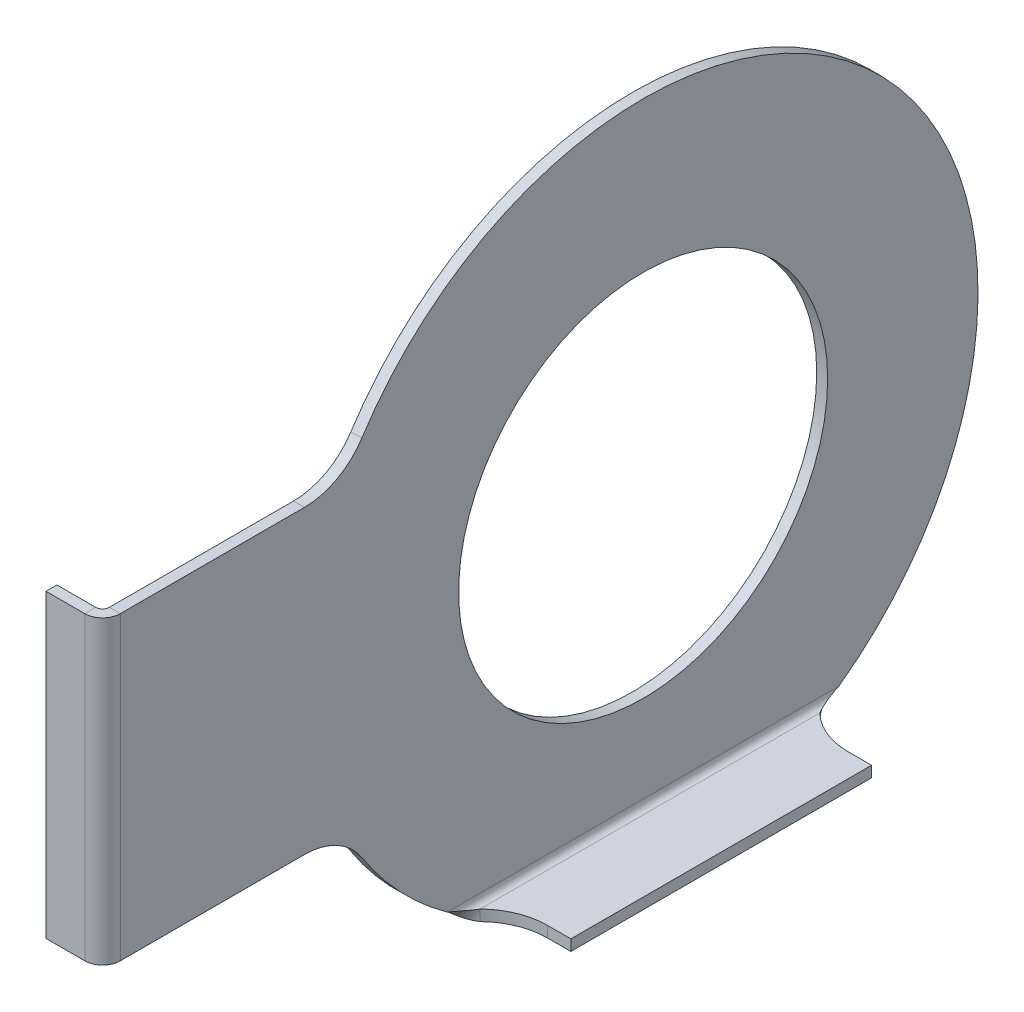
ISO-10303-21;
HEADER;
FILE_DESCRIPTION(('STEP AP214'),'2;1');
FILE_NAME('part.step','',(''),(''),'','','');
FILE_SCHEMA(('AUTOMOTIVE_DESIGN { 1 0 10303 214 1 1 1 1 }'));
ENDSEC;
DATA;
#1=APPLICATION_CONTEXT('core data for automotive mechanical design processes');
#2=APPLICATION_PROTOCOL_DEFINITION('international standard','automotive_design',2000,#1);
#3=PRODUCT_CONTEXT('',#1,'mechanical');
#4=PRODUCT('Part','Part','',(#3));
#5=PRODUCT_RELATED_PRODUCT_CATEGORY('part','',(#4));
#6=PRODUCT_DEFINITION_FORMATION('','',#4);
#7=PRODUCT_DEFINITION_CONTEXT('part definition',#1,'design');
#8=PRODUCT_DEFINITION('design','',#6,#7);
#9=PRODUCT_DEFINITION_SHAPE('','',#8);
#10=(LENGTH_UNIT() NAMED_UNIT(*) SI_UNIT(.MILLI.,.METRE.));
#11=(NAMED_UNIT(*) PLANE_ANGLE_UNIT() SI_UNIT($,.RADIAN.));
#12=(NAMED_UNIT(*) SI_UNIT($,.STERADIAN.) SOLID_ANGLE_UNIT());
#13=UNCERTAINTY_MEASURE_WITH_UNIT(LENGTH_MEASURE(1.E-05),#10,'distance_accuracy_value','');
#14=(GEOMETRIC_REPRESENTATION_CONTEXT(3) GLOBAL_UNCERTAINTY_ASSIGNED_CONTEXT((#13)) GLOBAL_UNIT_ASSIGNED_CONTEXT((#10,
#11,#12)) REPRESENTATION_CONTEXT('',''));
#15=CARTESIAN_POINT('',(0.,0.,0.));
#16=DIRECTION('',(0.,0.,1.));
#17=DIRECTION('',(1.,0.,0.));
#18=AXIS2_PLACEMENT_3D('',#15,#16,#17);
#19=CARTESIAN_POINT('',(0.,32.,49.5681349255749));
#20=DIRECTION('',(-1.,0.,0.));
#21=DIRECTION('',(0.,0.,1.));
#22=AXIS2_PLACEMENT_3D('',#19,#20,#21);
#23=PLANE('',#22);
#24=CARTESIAN_POINT('',(0.,0.,0.));
#25=DIRECTION('',(1.,0.,0.));
#26=DIRECTION('',(0.,0.,-1.));
#27=AXIS2_PLACEMENT_3D('',#24,#25,#26);
#28=CIRCLE('',#27,27.);
#29=CARTESIAN_POINT('',(0.,0.,-27.));
#30=VERTEX_POINT('',#29);
#31=EDGE_CURVE('E666',#30,#30,#28,.T.);
#32=ORIENTED_EDGE('',*,*,#31,.T.);
#33=EDGE_LOOP('',(#32));
#34=FACE_BOUND('',#33,.T.);
#35=DIRECTION('',(0.,0.,-1.));
#36=VECTOR('',#35,1.);
#37=CARTESIAN_POINT('',(0.,-22.,49.5681349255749));
#38=LINE('',#37,#36);
#39=CARTESIAN_POINT('',(0.,-22.,76.5));
#40=VERTEX_POINT('',#39);
#41=CARTESIAN_POINT('',(0.,-22.,49.5681349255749));
#42=VERTEX_POINT('',#41);
#43=EDGE_CURVE('E95',#40,#42,#38,.T.);
#44=ORIENTED_EDGE('',*,*,#43,.F.);
#45=DIRECTION('',(0.,1.,0.));
#46=VECTOR('',#45,1.);
#47=CARTESIAN_POINT('',(0.,32.,76.5));
#48=LINE('',#47,#46);
#49=CARTESIAN_POINT('',(0.,22.,76.5));
#50=VERTEX_POINT('',#49);
#51=EDGE_CURVE('E83',#40,#50,#48,.T.);
#52=ORIENTED_EDGE('',*,*,#51,.T.);
#53=DIRECTION('',(0.,0.,1.));
#54=VECTOR('',#53,1.);
#55=CARTESIAN_POINT('',(0.,22.,49.5681349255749));
#56=LINE('',#55,#54);
#57=CARTESIAN_POINT('',(0.,22.,49.5681349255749));
#58=VERTEX_POINT('',#57);
#59=EDGE_CURVE('E99',#58,#50,#56,.T.);
#60=ORIENTED_EDGE('',*,*,#59,.F.);
#61=CARTESIAN_POINT('',(0.,32.,49.5681349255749));
#62=DIRECTION('',(-1.,0.,0.));
#63=DIRECTION('',(0.,0.,1.));
#64=AXIS2_PLACEMENT_3D('',#61,#62,#63);
#65=CIRCLE('',#64,10.);
#66=CARTESIAN_POINT('',(0.,26.5762711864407,41.16675612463));
#67=VERTEX_POINT('',#66);
#68=EDGE_CURVE('E645',#67,#58,#65,.T.);
#69=ORIENTED_EDGE('',*,*,#68,.F.);
#70=CARTESIAN_POINT('',(0.,0.,0.));
#71=DIRECTION('',(1.,0.,0.));
#72=DIRECTION('',(0.,0.,-1.));
#73=AXIS2_PLACEMENT_3D('',#70,#71,#72);
#74=CIRCLE('',#73,49.);
#75=CARTESIAN_POINT('',(0.,-39.75,-28.6520069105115));
#76=VERTEX_POINT('',#75);
#77=EDGE_CURVE('E535',#76,#67,#74,.T.);
#78=ORIENTED_EDGE('',*,*,#77,.F.);
#79=DIRECTION('',(0.,0.,1.));
#80=VECTOR('',#79,1.);
#81=CARTESIAN_POINT('',(0.,-39.75,49.5681349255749));
#82=LINE('',#81,#80);
#83=CARTESIAN_POINT('',(0.,-39.75,28.6520069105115));
#84=VERTEX_POINT('',#83);
#85=EDGE_CURVE('E498',#76,#84,#82,.T.);
#86=ORIENTED_EDGE('',*,*,#85,.T.);
#87=CARTESIAN_POINT('',(0.,0.,0.));
#88=DIRECTION('',(1.,0.,0.));
#89=DIRECTION('',(0.,0.,-1.));
#90=AXIS2_PLACEMENT_3D('',#87,#88,#89);
#91=CIRCLE('',#90,49.);
#92=CARTESIAN_POINT('',(0.,-26.5762711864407,41.16675612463));
#93=VERTEX_POINT('',#92);
#94=EDGE_CURVE('E660',#93,#84,#91,.T.);
#95=ORIENTED_EDGE('',*,*,#94,.F.);
#96=CARTESIAN_POINT('',(0.,-32.,49.5681349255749));
#97=DIRECTION('',(-1.,0.,0.));
#98=DIRECTION('',(0.,0.,-1.));
#99=AXIS2_PLACEMENT_3D('',#96,#97,#98);
#100=CIRCLE('',#99,10.);
#101=EDGE_CURVE('E483',#42,#93,#100,.T.);
#102=ORIENTED_EDGE('',*,*,#101,.F.);
#103=EDGE_LOOP('',(#44,#52,#60,#69,#78,#86,#95,#102));
#104=FACE_BOUND('',#103,.T.);
#105=ADVANCED_FACE('F74',(#34,#104),#23,.T.);
#106=CARTESIAN_POINT('',(9.59070153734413,-40.75,-32.));
#107=DIRECTION('',(0.,-1.,0.));
#108=DIRECTION('',(0.,0.,1.));
#109=AXIS2_PLACEMENT_3D('',#106,#107,#108);
#110=CYLINDRICAL_SURFACE('',#109,10.);
#111=CARTESIAN_POINT('',(9.59070153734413,-42.35,-32.));
#112=DIRECTION('',(0.,-1.,0.));
#113=DIRECTION('',(0.,0.,-1.));
#114=AXIS2_PLACEMENT_3D('',#111,#112,#113);
#115=CIRCLE('',#114,10.);
#116=CARTESIAN_POINT('',(9.59070153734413,-42.35,-22.));
#117=VERTEX_POINT('',#116);
#118=CARTESIAN_POINT('',(2.60000000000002,-42.35,-24.8494691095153));
#119=VERTEX_POINT('',#118);
#120=EDGE_CURVE('E553',#117,#119,#115,.T.);
#121=ORIENTED_EDGE('',*,*,#120,.T.);
#122=CARTESIAN_POINT('',(2.60000000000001,-40.75,-24.8494691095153));
#123=CARTESIAN_POINT('',(2.60000000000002,-42.35,-24.8494691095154));
#124=B_SPLINE_CURVE_WITH_KNOTS('',1,(#122,#123),.UNSPECIFIED.,.F.,.F.,(2,2),(0.,1.),.UNSPECIFIED.);
#125=CARTESIAN_POINT('',(2.60000000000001,-40.75,-24.8494691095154));
#126=VERTEX_POINT('',#125);
#127=EDGE_CURVE('E350',#119,#126,#124,.F.);
#128=ORIENTED_EDGE('',*,*,#127,.T.);
#129=CARTESIAN_POINT('',(9.59070153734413,-40.75,-32.));
#130=DIRECTION('',(0.,-1.,0.));
#131=DIRECTION('',(0.,0.,-1.));
#132=AXIS2_PLACEMENT_3D('',#129,#130,#131);
#133=CIRCLE('',#132,10.);
#134=CARTESIAN_POINT('',(9.59070153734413,-40.75,-22.));
#135=VERTEX_POINT('',#134);
#136=EDGE_CURVE('E542',#135,#126,#133,.T.);
#137=ORIENTED_EDGE('',*,*,#136,.F.);
#138=DIRECTION('',(0.,-1.,0.));
#139=VECTOR('',#138,1.);
#140=CARTESIAN_POINT('',(9.59070153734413,-40.75,-22.));
#141=LINE('',#140,#139);
#142=EDGE_CURVE('E552',#135,#117,#141,.T.);
#143=ORIENTED_EDGE('',*,*,#142,.T.);
#144=EDGE_LOOP('',(#121,#128,#137,#143));
#145=FACE_BOUND('',#144,.T.);
#146=ADVANCED_FACE('F584',(#145),#110,.F.);
#147=CARTESIAN_POINT('',(9.59070153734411,-40.75,32.));
#148=DIRECTION('',(0.,-1.,0.));
#149=DIRECTION('',(0.,0.,1.));
#150=AXIS2_PLACEMENT_3D('',#147,#148,#149);
#151=CYLINDRICAL_SURFACE('',#150,10.);
#152=CARTESIAN_POINT('',(9.59070153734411,-40.75,32.));
#153=DIRECTION('',(0.,-1.,0.));
#154=DIRECTION('',(0.,0.,-1.));
#155=AXIS2_PLACEMENT_3D('',#152,#153,#154);
#156=CIRCLE('',#155,10.);
#157=CARTESIAN_POINT('',(2.6,-40.75,24.8494691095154));
#158=VERTEX_POINT('',#157);
#159=CARTESIAN_POINT('',(9.59070153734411,-40.75,22.));
#160=VERTEX_POINT('',#159);
#161=EDGE_CURVE('E538',#158,#160,#156,.T.);
#162=ORIENTED_EDGE('',*,*,#161,.F.);
#163=CARTESIAN_POINT('',(2.60000000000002,-42.35,24.8494691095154));
#164=CARTESIAN_POINT('',(2.60000000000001,-40.75,24.8494691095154));
#165=B_SPLINE_CURVE_WITH_KNOTS('',1,(#163,#164),.UNSPECIFIED.,.F.,.F.,(2,2),(0.,1.),.UNSPECIFIED.);
#166=CARTESIAN_POINT('',(2.60000000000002,-42.35,24.8494691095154));
#167=VERTEX_POINT('',#166);
#168=EDGE_CURVE('E419',#158,#167,#165,.F.);
#169=ORIENTED_EDGE('',*,*,#168,.T.);
#170=CARTESIAN_POINT('',(9.59070153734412,-42.35,32.));
#171=DIRECTION('',(0.,-1.,0.));
#172=DIRECTION('',(0.,0.,-1.));
#173=AXIS2_PLACEMENT_3D('',#170,#171,#172);
#174=CIRCLE('',#173,10.);
#175=CARTESIAN_POINT('',(9.59070153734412,-42.35,22.));
#176=VERTEX_POINT('',#175);
#177=EDGE_CURVE('E550',#167,#176,#174,.T.);
#178=ORIENTED_EDGE('',*,*,#177,.T.);
#179=DIRECTION('',(0.,-1.,0.));
#180=VECTOR('',#179,1.);
#181=CARTESIAN_POINT('',(9.59070153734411,-40.75,22.));
#182=LINE('',#181,#180);
#183=EDGE_CURVE('E561',#160,#176,#182,.T.);
#184=ORIENTED_EDGE('',*,*,#183,.F.);
#185=EDGE_LOOP('',(#162,#169,#178,#184));
#186=FACE_BOUND('',#185,.T.);
#187=ADVANCED_FACE('F592',(#186),#151,.F.);
#188=CARTESIAN_POINT('',(-71.9774333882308,-40.7500000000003,49.5681349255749));
#189=DIRECTION('',(0.,-1.,0.));
#190=DIRECTION('',(0.,0.,1.));
#191=AXIS2_PLACEMENT_3D('',#188,#189,#190);
#192=PLANE('',#191);
#193=ORIENTED_EDGE('',*,*,#136,.T.);
#194=DIRECTION('',(0.,0.,1.));
#195=VECTOR('',#194,1.);
#196=CARTESIAN_POINT('',(2.59999999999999,-40.75,49.5681349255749));
#197=LINE('',#196,#195);
#198=EDGE_CURVE('E562',#126,#158,#197,.T.);
#199=ORIENTED_EDGE('',*,*,#198,.T.);
#200=ORIENTED_EDGE('',*,*,#161,.T.);
#201=DIRECTION('',(1.,0.,0.));
#202=VECTOR('',#201,1.);
#203=CARTESIAN_POINT('',(9.59070153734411,-40.75,22.));
#204=LINE('',#203,#202);
#205=CARTESIAN_POINT('',(13.0225666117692,-40.75,22.));
#206=VERTEX_POINT('',#205);
#207=EDGE_CURVE('E536',#160,#206,#204,.T.);
#208=ORIENTED_EDGE('',*,*,#207,.T.);
#209=DIRECTION('',(0.,0.,-1.));
#210=VECTOR('',#209,1.);
#211=CARTESIAN_POINT('',(13.0225666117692,-40.75,22.));
#212=LINE('',#211,#210);
#213=CARTESIAN_POINT('',(13.0225666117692,-40.75,-22.));
#214=VERTEX_POINT('',#213);
#215=EDGE_CURVE('E539',#206,#214,#212,.T.);
#216=ORIENTED_EDGE('',*,*,#215,.T.);
#217=DIRECTION('',(-1.,0.,0.));
#218=VECTOR('',#217,1.);
#219=CARTESIAN_POINT('',(9.59070153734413,-40.75,-22.));
#220=LINE('',#219,#218);
#221=EDGE_CURVE('E541',#214,#135,#220,.T.);
#222=ORIENTED_EDGE('',*,*,#221,.T.);
#223=EDGE_LOOP('',(#193,#199,#200,#208,#216,#222));
#224=FACE_BOUND('',#223,.T.);
#225=ADVANCED_FACE('F593',(#224),#192,.F.);
#226=CARTESIAN_POINT('',(-71.9774333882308,-42.3500000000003,49.5681349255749));
#227=DIRECTION('',(0.,-1.,0.));
#228=DIRECTION('',(0.,0.,1.));
#229=AXIS2_PLACEMENT_3D('',#226,#227,#228);
#230=PLANE('',#229);
#231=DIRECTION('',(0.,0.,1.));
#232=VECTOR('',#231,1.);
#233=CARTESIAN_POINT('',(2.6,-42.35,49.5681349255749));
#234=LINE('',#233,#232);
#235=EDGE_CURVE('E988',#119,#167,#234,.T.);
#236=ORIENTED_EDGE('',*,*,#235,.F.);
#237=ORIENTED_EDGE('',*,*,#120,.F.);
#238=DIRECTION('',(-1.,0.,0.));
#239=VECTOR('',#238,1.);
#240=CARTESIAN_POINT('',(9.59070153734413,-42.35,-22.));
#241=LINE('',#240,#239);
#242=CARTESIAN_POINT('',(13.0225666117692,-42.35,-22.));
#243=VERTEX_POINT('',#242);
#244=EDGE_CURVE('E548',#243,#117,#241,.T.);
#245=ORIENTED_EDGE('',*,*,#244,.F.);
#246=DIRECTION('',(0.,0.,-1.));
#247=VECTOR('',#246,1.);
#248=CARTESIAN_POINT('',(13.0225666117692,-42.35,22.));
#249=LINE('',#248,#247);
#250=CARTESIAN_POINT('',(13.0225666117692,-42.35,22.));
#251=VERTEX_POINT('',#250);
#252=EDGE_CURVE('E546',#251,#243,#249,.T.);
#253=ORIENTED_EDGE('',*,*,#252,.F.);
#254=DIRECTION('',(1.,0.,0.));
#255=VECTOR('',#254,1.);
#256=CARTESIAN_POINT('',(9.59070153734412,-42.35,22.));
#257=LINE('',#256,#255);
#258=EDGE_CURVE('E543',#176,#251,#257,.T.);
#259=ORIENTED_EDGE('',*,*,#258,.F.);
#260=ORIENTED_EDGE('',*,*,#177,.F.);
#261=EDGE_LOOP('',(#236,#237,#245,#253,#259,#260));
#262=FACE_BOUND('',#261,.T.);
#263=ADVANCED_FACE('F597',(#262),#230,.T.);
#264=CARTESIAN_POINT('',(9.59070153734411,-40.75,22.));
#265=DIRECTION('',(0.,0.,-1.));
#266=DIRECTION('',(0.,-1.,0.));
#267=AXIS2_PLACEMENT_3D('',#264,#265,#266);
#268=PLANE('',#267);
#269=ORIENTED_EDGE('',*,*,#258,.T.);
#270=DIRECTION('',(0.,-1.,0.));
#271=VECTOR('',#270,1.);
#272=CARTESIAN_POINT('',(13.0225666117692,-40.75,22.));
#273=LINE('',#272,#271);
#274=EDGE_CURVE('E556',#206,#251,#273,.T.);
#275=ORIENTED_EDGE('',*,*,#274,.F.);
#276=ORIENTED_EDGE('',*,*,#207,.F.);
#277=ORIENTED_EDGE('',*,*,#183,.T.);
#278=EDGE_LOOP('',(#269,#275,#276,#277));
#279=FACE_BOUND('',#278,.T.);
#280=ADVANCED_FACE('F599',(#279),#268,.F.);
#281=CARTESIAN_POINT('',(13.0225666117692,-40.75,22.));
#282=DIRECTION('',(-1.,0.,0.));
#283=DIRECTION('',(0.,0.,1.));
#284=AXIS2_PLACEMENT_3D('',#281,#282,#283);
#285=PLANE('',#284);
#286=ORIENTED_EDGE('',*,*,#252,.T.);
#287=DIRECTION('',(0.,-1.,0.));
#288=VECTOR('',#287,1.);
#289=CARTESIAN_POINT('',(13.0225666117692,-40.75,-22.));
#290=LINE('',#289,#288);
#291=EDGE_CURVE('E554',#214,#243,#290,.T.);
#292=ORIENTED_EDGE('',*,*,#291,.F.);
#293=ORIENTED_EDGE('',*,*,#215,.F.);
#294=ORIENTED_EDGE('',*,*,#274,.T.);
#295=EDGE_LOOP('',(#286,#292,#293,#294));
#296=FACE_BOUND('',#295,.T.);
#297=ADVANCED_FACE('F690',(#296),#285,.F.);
#298=CARTESIAN_POINT('',(9.59070153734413,-40.75,-22.));
#299=DIRECTION('',(0.,0.,1.));
#300=DIRECTION('',(0.,1.,0.));
#301=AXIS2_PLACEMENT_3D('',#298,#299,#300);
#302=PLANE('',#301);
#303=ORIENTED_EDGE('',*,*,#244,.T.);
#304=ORIENTED_EDGE('',*,*,#142,.F.);
#305=ORIENTED_EDGE('',*,*,#221,.F.);
#306=ORIENTED_EDGE('',*,*,#291,.T.);
#307=EDGE_LOOP('',(#303,#304,#305,#306));
#308=FACE_BOUND('',#307,.T.);
#309=ADVANCED_FACE('F517',(#308),#302,.F.);
#310=CARTESIAN_POINT('',(1.6,0.,0.));
#311=DIRECTION('',(-1.,0.,0.));
#312=DIRECTION('',(0.,0.,1.));
#313=AXIS2_PLACEMENT_3D('',#310,#311,#312);
#314=CYLINDRICAL_SURFACE('',#313,27.);
#315=CARTESIAN_POINT('',(1.6,0.,0.));
#316=DIRECTION('',(1.,0.,0.));
#317=DIRECTION('',(0.,0.,-1.));
#318=AXIS2_PLACEMENT_3D('',#315,#316,#317);
#319=CIRCLE('',#318,27.);
#320=CARTESIAN_POINT('',(1.6,0.,-27.));
#321=VERTEX_POINT('',#320);
#322=EDGE_CURVE('E481',#321,#321,#319,.T.);
#323=ORIENTED_EDGE('',*,*,#322,.T.);
#324=EDGE_LOOP('',(#323));
#325=FACE_BOUND('',#324,.T.);
#326=ORIENTED_EDGE('',*,*,#31,.F.);
#327=EDGE_LOOP('',(#326));
#328=FACE_BOUND('',#327,.T.);
#329=ADVANCED_FACE('F679',(#325,#328),#314,.F.);
#330=CARTESIAN_POINT('',(1.6,-32.,49.5681349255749));
#331=DIRECTION('',(-1.,0.,0.));
#332=DIRECTION('',(0.,0.,1.));
#333=AXIS2_PLACEMENT_3D('',#330,#331,#332);
#334=CYLINDRICAL_SURFACE('',#333,10.);
#335=ORIENTED_EDGE('',*,*,#101,.T.);
#336=DIRECTION('',(-1.,0.,0.));
#337=VECTOR('',#336,1.);
#338=CARTESIAN_POINT('',(1.6,-26.5762711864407,41.16675612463));
#339=LINE('',#338,#337);
#340=CARTESIAN_POINT('',(1.6,-26.5762711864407,41.16675612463));
#341=VERTEX_POINT('',#340);
#342=EDGE_CURVE('E652',#341,#93,#339,.T.);
#343=ORIENTED_EDGE('',*,*,#342,.F.);
#344=CARTESIAN_POINT('',(1.6,-32.,49.5681349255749));
#345=DIRECTION('',(-1.,0.,0.));
#346=DIRECTION('',(0.,0.,-1.));
#347=AXIS2_PLACEMENT_3D('',#344,#345,#346);
#348=CIRCLE('',#347,10.);
#349=CARTESIAN_POINT('',(1.6,-22.,49.5681349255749));
#350=VERTEX_POINT('',#349);
#351=EDGE_CURVE('E531',#350,#341,#348,.T.);
#352=ORIENTED_EDGE('',*,*,#351,.F.);
#353=DIRECTION('',(-1.,0.,0.));
#354=VECTOR('',#353,1.);
#355=CARTESIAN_POINT('',(1.6,-22.,49.5681349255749));
#356=LINE('',#355,#354);
#357=EDGE_CURVE('E622',#350,#42,#356,.T.);
#358=ORIENTED_EDGE('',*,*,#357,.T.);
#359=EDGE_LOOP('',(#335,#343,#352,#358));
#360=FACE_BOUND('',#359,.T.);
#361=ADVANCED_FACE('F651',(#360),#334,.F.);
#362=CARTESIAN_POINT('',(1.6,-22.,49.5681349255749));
#363=DIRECTION('',(0.,1.,0.));
#364=DIRECTION('',(0.,0.,1.));
#365=AXIS2_PLACEMENT_3D('',#362,#363,#364);
#366=PLANE('',#365);
#367=DIRECTION('',(1.,0.,0.));
#368=VECTOR('',#367,1.);
#369=CARTESIAN_POINT('',(1.6,-22.,76.5));
#370=LINE('',#369,#368);
#371=CARTESIAN_POINT('',(1.6,-22.,76.5));
#372=VERTEX_POINT('',#371);
#373=EDGE_CURVE('E12',#40,#372,#370,.T.);
#374=ORIENTED_EDGE('',*,*,#373,.F.);
#375=ORIENTED_EDGE('',*,*,#43,.T.);
#376=ORIENTED_EDGE('',*,*,#357,.F.);
#377=DIRECTION('',(0.,0.,-1.));
#378=VECTOR('',#377,1.);
#379=CARTESIAN_POINT('',(1.6,-22.,49.5681349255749));
#380=LINE('',#379,#378);
#381=EDGE_CURVE('E79',#372,#350,#380,.T.);
#382=ORIENTED_EDGE('',*,*,#381,.F.);
#383=EDGE_LOOP('',(#374,#375,#376,#382));
#384=FACE_BOUND('',#383,.T.);
#385=ADVANCED_FACE('F80',(#384),#366,.F.);
#386=CARTESIAN_POINT('',(1.6,22.,49.5681349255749));
#387=DIRECTION('',(0.,-1.,0.));
#388=DIRECTION('',(0.,0.,-1.));
#389=AXIS2_PLACEMENT_3D('',#386,#387,#388);
#390=PLANE('',#389);
#391=DIRECTION('',(-1.,0.,0.));
#392=VECTOR('',#391,1.);
#393=CARTESIAN_POINT('',(1.6,22.,76.5));
#394=LINE('',#393,#392);
#395=CARTESIAN_POINT('',(1.6,22.,76.5));
#396=VERTEX_POINT('',#395);
#397=EDGE_CURVE('E619',#396,#50,#394,.T.);
#398=ORIENTED_EDGE('',*,*,#397,.F.);
#399=DIRECTION('',(0.,0.,1.));
#400=VECTOR('',#399,1.);
#401=CARTESIAN_POINT('',(1.6,22.,49.5681349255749));
#402=LINE('',#401,#400);
#403=CARTESIAN_POINT('',(1.6,22.,49.5681349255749));
#404=VERTEX_POINT('',#403);
#405=EDGE_CURVE('E630',#404,#396,#402,.T.);
#406=ORIENTED_EDGE('',*,*,#405,.F.);
#407=DIRECTION('',(-1.,0.,0.));
#408=VECTOR('',#407,1.);
#409=CARTESIAN_POINT('',(1.6,22.,49.5681349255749));
#410=LINE('',#409,#408);
#411=EDGE_CURVE('E626',#404,#58,#410,.T.);
#412=ORIENTED_EDGE('',*,*,#411,.T.);
#413=ORIENTED_EDGE('',*,*,#59,.T.);
#414=EDGE_LOOP('',(#398,#406,#412,#413));
#415=FACE_BOUND('',#414,.T.);
#416=ADVANCED_FACE('F692',(#415),#390,.F.);
#417=CARTESIAN_POINT('',(1.6,32.,49.5681349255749));
#418=DIRECTION('',(-1.,0.,0.));
#419=DIRECTION('',(0.,0.,1.));
#420=AXIS2_PLACEMENT_3D('',#417,#418,#419);
#421=CYLINDRICAL_SURFACE('',#420,10.);
#422=ORIENTED_EDGE('',*,*,#68,.T.);
#423=ORIENTED_EDGE('',*,*,#411,.F.);
#424=CARTESIAN_POINT('',(1.6,32.,49.5681349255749));
#425=DIRECTION('',(-1.,0.,0.));
#426=DIRECTION('',(0.,0.,1.));
#427=AXIS2_PLACEMENT_3D('',#424,#425,#426);
#428=CIRCLE('',#427,10.);
#429=CARTESIAN_POINT('',(1.6,26.5762711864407,41.16675612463));
#430=VERTEX_POINT('',#429);
#431=EDGE_CURVE('E628',#430,#404,#428,.T.);
#432=ORIENTED_EDGE('',*,*,#431,.F.);
#433=DIRECTION('',(-1.,0.,0.));
#434=VECTOR('',#433,1.);
#435=CARTESIAN_POINT('',(1.6,26.5762711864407,41.16675612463));
#436=LINE('',#435,#434);
#437=EDGE_CURVE('E636',#430,#67,#436,.T.);
#438=ORIENTED_EDGE('',*,*,#437,.T.);
#439=EDGE_LOOP('',(#422,#423,#432,#438));
#440=FACE_BOUND('',#439,.T.);
#441=ADVANCED_FACE('F512',(#440),#421,.F.);
#442=CARTESIAN_POINT('',(1.6,32.,49.5681349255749));
#443=DIRECTION('',(-1.,0.,0.));
#444=DIRECTION('',(0.,0.,1.));
#445=AXIS2_PLACEMENT_3D('',#442,#443,#444);
#446=PLANE('',#445);
#447=DIRECTION('',(0.,1.,0.));
#448=VECTOR('',#447,1.);
#449=CARTESIAN_POINT('',(1.6,32.,76.5));
#450=LINE('',#449,#448);
#451=EDGE_CURVE('E615',#372,#396,#450,.T.);
#452=ORIENTED_EDGE('',*,*,#451,.F.);
#453=ORIENTED_EDGE('',*,*,#381,.T.);
#454=ORIENTED_EDGE('',*,*,#351,.T.);
#455=CARTESIAN_POINT('',(1.6,0.,0.));
#456=DIRECTION('',(1.,0.,0.));
#457=DIRECTION('',(0.,0.,-1.));
#458=AXIS2_PLACEMENT_3D('',#455,#456,#457);
#459=CIRCLE('',#458,49.);
#460=CARTESIAN_POINT('',(1.6,-39.75,28.6520069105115));
#461=VERTEX_POINT('',#460);
#462=EDGE_CURVE('E524',#341,#461,#459,.T.);
#463=ORIENTED_EDGE('',*,*,#462,.T.);
#464=DIRECTION('',(0.,0.,1.));
#465=VECTOR('',#464,1.);
#466=CARTESIAN_POINT('',(1.6,-39.75,49.5681349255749));
#467=LINE('',#466,#465);
#468=CARTESIAN_POINT('',(1.6,-39.75,-28.6520069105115));
#469=VERTEX_POINT('',#468);
#470=EDGE_CURVE('E310',#469,#461,#467,.T.);
#471=ORIENTED_EDGE('',*,*,#470,.F.);
#472=CARTESIAN_POINT('',(1.6,0.,0.));
#473=DIRECTION('',(1.,0.,0.));
#474=DIRECTION('',(0.,0.,-1.));
#475=AXIS2_PLACEMENT_3D('',#472,#473,#474);
#476=CIRCLE('',#475,49.);
#477=EDGE_CURVE('E635',#469,#430,#476,.T.);
#478=ORIENTED_EDGE('',*,*,#477,.T.);
#479=ORIENTED_EDGE('',*,*,#431,.T.);
#480=ORIENTED_EDGE('',*,*,#405,.T.);
#481=EDGE_LOOP('',(#452,#453,#454,#463,#471,#478,#479,#480));
#482=FACE_BOUND('',#481,.T.);
#483=ORIENTED_EDGE('',*,*,#322,.F.);
#484=EDGE_LOOP('',(#483));
#485=FACE_BOUND('',#484,.T.);
#486=ADVANCED_FACE('F509',(#482,#485),#446,.F.);
#487=CARTESIAN_POINT('',(1.6,0.,0.));
#488=DIRECTION('',(-1.,0.,0.));
#489=DIRECTION('',(0.,0.,1.));
#490=AXIS2_PLACEMENT_3D('',#487,#488,#489);
#491=CYLINDRICAL_SURFACE('',#490,49.);
#492=CARTESIAN_POINT('',(0.,-39.75,-28.6520069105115));
#493=CARTESIAN_POINT('',(1.6,-39.75,-28.6520069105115));
#494=B_SPLINE_CURVE_WITH_KNOTS('',1,(#492,#493),.UNSPECIFIED.,.F.,.F.,(2,2),(0.,1.),.UNSPECIFIED.);
#495=EDGE_CURVE('E468',#76,#469,#494,.T.);
#496=ORIENTED_EDGE('',*,*,#495,.F.);
#497=ORIENTED_EDGE('',*,*,#77,.T.);
#498=ORIENTED_EDGE('',*,*,#437,.F.);
#499=ORIENTED_EDGE('',*,*,#477,.F.);
#500=EDGE_LOOP('',(#496,#497,#498,#499));
#501=FACE_BOUND('',#500,.T.);
#502=ADVANCED_FACE('F499',(#501),#491,.T.);
#503=CARTESIAN_POINT('',(1.6,0.,0.));
#504=DIRECTION('',(-1.,0.,0.));
#505=DIRECTION('',(0.,0.,1.));
#506=AXIS2_PLACEMENT_3D('',#503,#504,#505);
#507=CYLINDRICAL_SURFACE('',#506,49.);
#508=CARTESIAN_POINT('',(1.6,-39.75,28.6520069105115));
#509=CARTESIAN_POINT('',(0.,-39.75,28.6520069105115));
#510=B_SPLINE_CURVE_WITH_KNOTS('',1,(#508,#509),.UNSPECIFIED.,.F.,.F.,(2,2),(0.,1.),.UNSPECIFIED.);
#511=EDGE_CURVE('E485',#461,#84,#510,.T.);
#512=ORIENTED_EDGE('',*,*,#511,.F.);
#513=ORIENTED_EDGE('',*,*,#462,.F.);
#514=ORIENTED_EDGE('',*,*,#342,.T.);
#515=ORIENTED_EDGE('',*,*,#94,.T.);
#516=EDGE_LOOP('',(#512,#513,#514,#515));
#517=FACE_BOUND('',#516,.T.);
#518=ADVANCED_FACE('F372',(#517),#507,.T.);
#519=CARTESIAN_POINT('',(2.60000000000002,-42.35,-24.8494691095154));
#520=CARTESIAN_POINT('',(2.59490760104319,-42.35,-24.8533904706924));
#521=CARTESIAN_POINT('',(2.54515515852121,-42.3511276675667,-24.8907731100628));
#522=CARTESIAN_POINT('',(2.40409132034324,-42.3430364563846,-24.9969590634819));
#523=CARTESIAN_POINT('',(2.34599730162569,-42.3384927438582,-25.0407108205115));
#524=CARTESIAN_POINT('',(2.24274906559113,-42.3255727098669,-25.1188731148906));
#525=CARTESIAN_POINT('',(2.20565379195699,-42.3202356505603,-25.1470163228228));
#526=CARTESIAN_POINT('',(2.14612289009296,-42.3101563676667,-25.1923647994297));
#527=CARTESIAN_POINT('',(2.12563183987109,-42.3064502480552,-25.2080032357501));
#528=CARTESIAN_POINT('',(2.09394645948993,-42.3002991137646,-25.2322443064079));
#529=CARTESIAN_POINT('',(2.08322657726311,-42.2981500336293,-25.2404552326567));
#530=CARTESIAN_POINT('',(2.06691284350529,-42.2947689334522,-25.2529674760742));
#531=CARTESIAN_POINT('',(2.06143595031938,-42.2936156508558,-25.2571708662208));
#532=CARTESIAN_POINT('',(2.0531625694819,-42.2918451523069,-25.2635249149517));
#533=CARTESIAN_POINT('',(2.0503951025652,-42.2912482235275,-25.2656510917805));
#534=CARTESIAN_POINT('',(2.04484089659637,-42.2900406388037,-25.2699197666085));
#535=CARTESIAN_POINT('',(2.04091453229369,-42.289178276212,-25.2729387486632));
#536=CARTESIAN_POINT('',(1.93322826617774,-42.2653938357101,-25.3557600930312));
#537=CARTESIAN_POINT('',(1.83715617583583,-42.237248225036,-25.4321639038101));
#538=CARTESIAN_POINT('',(1.70772538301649,-42.192525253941,-25.539054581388));
#539=CARTESIAN_POINT('',(1.66701908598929,-42.1771906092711,-25.5733989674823));
#540=CARTESIAN_POINT('',(1.59035577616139,-42.1463151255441,-25.6395160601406));
#541=CARTESIAN_POINT('',(1.55363443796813,-42.1304257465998,-25.6719805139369));
#542=CARTESIAN_POINT('',(1.25754830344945,-41.9953310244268,-25.940136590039));
#543=CARTESIAN_POINT('',(0.996527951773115,-41.8226961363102,-26.2314018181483));
#544=CARTESIAN_POINT('',(0.764629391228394,-41.5915794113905,-26.5762711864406));
#545=CARTESIAN_POINT('',(2.60000000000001,-40.75,-24.8494691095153));
#546=CARTESIAN_POINT('',(2.59803533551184,-40.75,-24.8534025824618));
#547=CARTESIAN_POINT('',(2.57890583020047,-40.7504337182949,-24.8907731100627));
#548=CARTESIAN_POINT('',(2.52465050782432,-40.7473217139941,-24.9969590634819));
#549=CARTESIAN_POINT('',(2.50230665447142,-40.7455741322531,-25.0407108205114));
#550=CARTESIAN_POINT('',(2.46259579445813,-40.7406048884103,-25.1188731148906));
#551=CARTESIAN_POINT('',(2.44832838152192,-40.7385521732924,-25.1470163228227));
#552=CARTESIAN_POINT('',(2.42543188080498,-40.7346755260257,-25.1923647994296));
#553=CARTESIAN_POINT('',(2.41755070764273,-40.7332500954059,-25.2080032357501));
#554=CARTESIAN_POINT('',(2.40536402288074,-40.7308842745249,-25.2322443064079));
#555=CARTESIAN_POINT('',(2.40124099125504,-40.730057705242,-25.2404552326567));
#556=CARTESIAN_POINT('',(2.39496647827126,-40.728757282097,-25.2529674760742));
#557=CARTESIAN_POINT('',(2.39285998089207,-40.7283137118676,-25.2571708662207));
#558=CARTESIAN_POINT('',(2.38967791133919,-40.7276327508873,-25.2635249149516));
#559=CARTESIAN_POINT('',(2.38861350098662,-40.7274031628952,-25.2656510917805));
#560=CARTESIAN_POINT('',(2.38647726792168,-40.7269387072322,-25.2699197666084));
#561=CARTESIAN_POINT('',(2.38496712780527,-40.7266070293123,-25.2729387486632));
#562=CARTESIAN_POINT('',(2.34354933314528,-40.7174591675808,-25.3557600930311));
#563=CARTESIAN_POINT('',(2.30659852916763,-40.7066339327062,-25.43216390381));
#564=CARTESIAN_POINT('',(2.25681745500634,-40.6894327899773,-25.539054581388));
#565=CARTESIAN_POINT('',(2.24116118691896,-40.6835348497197,-25.5733989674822));
#566=CARTESIAN_POINT('',(2.21167529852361,-40.6716596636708,-25.6395160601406));
#567=CARTESIAN_POINT('',(2.19755170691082,-40.6655483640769,-25.6719805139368));
#568=CARTESIAN_POINT('',(2.08367242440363,-40.6135888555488,-25.940136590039));
#569=CARTESIAN_POINT('',(1.98323461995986,-40.5471456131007,-26.2315772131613));
#570=CARTESIAN_POINT('',(1.89408822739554,-40.4582997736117,-26.5762711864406));
#571=B_SPLINE_SURFACE_WITH_KNOTS('',1,3,((#519,#520,#521,#522,#523,#524,#525,#526,#527,#528,
#529,#530,#531,#532,#533,#534,#535,#536,#537,#538,#539,#540,#541,#542,#543,#544),(#545,#546,
#547,#548,#549,#550,#551,#552,#553,#554,#555,#556,#557,#558,#559,#560,#561,#562,#563,#564,#565,
#566,#567,#568,#569,#570)),.UNSPECIFIED.,.F.,.F.,.F.,(2,2),(4,2,2,2,2,2,2,2,2,2,2,2,4),(0.,1.),
(0.,0.125,0.1875,0.21875,0.234375,0.2421875,0.24609375,0.248046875,0.25,0.375,0.4375,0.5,1.),.UNSPECIFIED.);
#572=CARTESIAN_POINT('',(2.60000000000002,-42.35,-24.8494691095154));
#573=CARTESIAN_POINT('',(2.59490760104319,-42.35,-24.8533904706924));
#574=CARTESIAN_POINT('',(2.54515515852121,-42.3511276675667,-24.8907731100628));
#575=CARTESIAN_POINT('',(2.40409132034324,-42.3430364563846,-24.9969590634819));
#576=CARTESIAN_POINT('',(2.34599730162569,-42.3384927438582,-25.0407108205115));
#577=CARTESIAN_POINT('',(2.24274906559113,-42.3255727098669,-25.1188731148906));
#578=CARTESIAN_POINT('',(2.20565379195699,-42.3202356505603,-25.1470163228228));
#579=CARTESIAN_POINT('',(2.14612289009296,-42.3101563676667,-25.1923647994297));
#580=CARTESIAN_POINT('',(2.12563183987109,-42.3064502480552,-25.2080032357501));
#581=CARTESIAN_POINT('',(2.09394645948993,-42.3002991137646,-25.2322443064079));
#582=CARTESIAN_POINT('',(2.08322657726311,-42.2981500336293,-25.2404552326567));
#583=CARTESIAN_POINT('',(2.06691284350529,-42.2947689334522,-25.2529674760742));
#584=CARTESIAN_POINT('',(2.06143595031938,-42.2936156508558,-25.2571708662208));
#585=CARTESIAN_POINT('',(2.0531625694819,-42.2918451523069,-25.2635249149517));
#586=CARTESIAN_POINT('',(2.0503951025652,-42.2912482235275,-25.2656510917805));
#587=CARTESIAN_POINT('',(2.04484089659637,-42.2900406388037,-25.2699197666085));
#588=CARTESIAN_POINT('',(2.04091453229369,-42.289178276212,-25.2729387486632));
#589=CARTESIAN_POINT('',(1.93322826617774,-42.2653938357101,-25.3557600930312));
#590=CARTESIAN_POINT('',(1.83715617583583,-42.237248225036,-25.4321639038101));
#591=CARTESIAN_POINT('',(1.70772538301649,-42.192525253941,-25.539054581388));
#592=CARTESIAN_POINT('',(1.66701908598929,-42.1771906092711,-25.5733989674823));
#593=CARTESIAN_POINT('',(1.59035577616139,-42.1463151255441,-25.6395160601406));
#594=CARTESIAN_POINT('',(1.55363443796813,-42.1304257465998,-25.6719805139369));
#595=CARTESIAN_POINT('',(1.25754830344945,-41.9953310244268,-25.940136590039));
#596=CARTESIAN_POINT('',(0.996527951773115,-41.8226961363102,-26.2314018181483));
#597=CARTESIAN_POINT('',(0.764629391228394,-41.5915794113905,-26.5762711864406));
#598=B_SPLINE_CURVE_WITH_KNOTS('',3,(#572,#573,#574,#575,#576,#577,#578,#579,#580,#581,#582,
#583,#584,#585,#586,#587,#588,#589,#590,#591,#592,#593,#594,#595,#596,#597),.UNSPECIFIED.,.F.,
.F.,(4,2,2,2,2,2,2,2,2,2,2,2,4),(0.,0.125,0.1875,0.21875,0.234375,0.2421875,0.24609375,
0.248046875,0.25,0.375,0.4375,0.5,1.),.UNSPECIFIED.);
#599=CARTESIAN_POINT('',(0.764629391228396,-41.5915794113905,-26.5762711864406));
#600=VERTEX_POINT('',#599);
#601=EDGE_CURVE('E252',#119,#600,#598,.T.);
#602=CARTESIAN_POINT('',(0.764629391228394,-41.5915794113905,-26.5762711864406));
#603=CARTESIAN_POINT('',(1.89408822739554,-40.4582997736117,-26.5762711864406));
#604=B_SPLINE_CURVE_WITH_KNOTS('',1,(#602,#603),.UNSPECIFIED.,.F.,.F.,(2,2),(0.,1.),.UNSPECIFIED.);
#605=CARTESIAN_POINT('',(1.89408822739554,-40.4582997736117,-26.5762711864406));
#606=VERTEX_POINT('',#605);
#607=EDGE_CURVE('E343',#600,#606,#604,.T.);
#608=CARTESIAN_POINT('',(1.89408822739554,-40.4582997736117,-26.5762711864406));
#609=CARTESIAN_POINT('',(1.98323461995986,-40.5471456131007,-26.2315772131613));
#610=CARTESIAN_POINT('',(2.08367242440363,-40.6135888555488,-25.940136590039));
#611=CARTESIAN_POINT('',(2.19755170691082,-40.6655483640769,-25.6719805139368));
#612=CARTESIAN_POINT('',(2.21167529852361,-40.6716596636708,-25.6395160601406));
#613=CARTESIAN_POINT('',(2.24116118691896,-40.6835348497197,-25.5733989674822));
#614=CARTESIAN_POINT('',(2.25681745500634,-40.6894327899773,-25.539054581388));
#615=CARTESIAN_POINT('',(2.30659852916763,-40.7066339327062,-25.43216390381));
#616=CARTESIAN_POINT('',(2.34354933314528,-40.7174591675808,-25.3557600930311));
#617=CARTESIAN_POINT('',(2.38496712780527,-40.7266070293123,-25.2729387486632));
#618=CARTESIAN_POINT('',(2.38647726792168,-40.7269387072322,-25.2699197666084));
#619=CARTESIAN_POINT('',(2.38861350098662,-40.7274031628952,-25.2656510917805));
#620=CARTESIAN_POINT('',(2.38967791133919,-40.7276327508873,-25.2635249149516));
#621=CARTESIAN_POINT('',(2.39285998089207,-40.7283137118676,-25.2571708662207));
#622=CARTESIAN_POINT('',(2.39496647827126,-40.728757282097,-25.2529674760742));
#623=CARTESIAN_POINT('',(2.40124099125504,-40.730057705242,-25.2404552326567));
#624=CARTESIAN_POINT('',(2.40536402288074,-40.7308842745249,-25.2322443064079));
#625=CARTESIAN_POINT('',(2.41755070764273,-40.7332500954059,-25.2080032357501));
#626=CARTESIAN_POINT('',(2.42543188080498,-40.7346755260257,-25.1923647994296));
#627=CARTESIAN_POINT('',(2.44832838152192,-40.7385521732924,-25.1470163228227));
#628=CARTESIAN_POINT('',(2.46259579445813,-40.7406048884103,-25.1188731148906));
#629=CARTESIAN_POINT('',(2.50230665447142,-40.7455741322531,-25.0407108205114));
#630=CARTESIAN_POINT('',(2.52465050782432,-40.7473217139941,-24.9969590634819));
#631=CARTESIAN_POINT('',(2.57890583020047,-40.7504337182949,-24.8907731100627));
#632=CARTESIAN_POINT('',(2.59803533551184,-40.75,-24.8534025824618));
#633=CARTESIAN_POINT('',(2.60000000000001,-40.75,-24.8494691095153));
#634=B_SPLINE_CURVE_WITH_KNOTS('',3,(#608,#609,#610,#611,#612,#613,#614,#615,#616,#617,#618,
#619,#620,#621,#622,#623,#624,#625,#626,#627,#628,#629,#630,#631,#632,#633),.UNSPECIFIED.,.F.,
.F.,(4,2,2,2,2,2,2,2,2,2,2,2,4),(0.,0.5,0.5625,0.625,0.75,0.751953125,0.75390625,0.7578125,
0.765625,0.78125,0.8125,0.875,1.),.UNSPECIFIED.);
#635=EDGE_CURVE('E309',#126,#606,#634,.F.);
#636=ORIENTED_EDGE('',*,*,#127,.F.);
#637=ORIENTED_EDGE('',*,*,#601,.T.);
#638=ORIENTED_EDGE('',*,*,#607,.T.);
#639=ORIENTED_EDGE('',*,*,#635,.F.);
#640=EDGE_LOOP('',(#636,#637,#638,#639));
#641=FACE_BOUND('',#640,.T.);
#642=ADVANCED_FACE('F344',(#641),#571,.F.);
#643=CARTESIAN_POINT('',(0.764629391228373,-41.5915794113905,-26.5762711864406));
#644=CARTESIAN_POINT('',(0.646547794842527,-41.4738959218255,-26.7500180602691));
#645=CARTESIAN_POINT('',(0.539823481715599,-41.3448244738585,-26.9237157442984));
#646=CARTESIAN_POINT('',(0.399715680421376,-41.1376948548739,-27.1841924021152));
#647=CARTESIAN_POINT('',(0.35633596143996,-41.0664041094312,-27.2710060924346));
#648=CARTESIAN_POINT('',(0.3065153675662,-40.9748928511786,-27.3795083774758));
#649=CARTESIAN_POINT('',(0.296252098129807,-40.9554315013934,-27.4024316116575));
#650=CARTESIAN_POINT('',(0.279896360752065,-40.9236433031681,-27.4396166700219));
#651=CARTESIAN_POINT('',(0.271790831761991,-40.9074869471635,-27.4583672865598));
#652=CARTESIAN_POINT('',(0.247730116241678,-40.8582248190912,-27.515093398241));
#653=CARTESIAN_POINT('',(0.232030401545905,-40.8243255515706,-27.5535431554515));
#654=CARTESIAN_POINT('',(0.0947759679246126,-40.5096043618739,-27.9052821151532));
#655=CARTESIAN_POINT('',(0.,-40.1584365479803,-28.2576297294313));
#656=CARTESIAN_POINT('',(0.,-39.75,-28.6520069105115));
#657=CARTESIAN_POINT('',(1.89408822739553,-40.4582997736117,-26.5762711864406));
#658=CARTESIAN_POINT('',(1.8486723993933,-40.4130370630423,-26.7500174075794));
#659=CARTESIAN_POINT('',(1.80762441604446,-40.3633940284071,-26.9237157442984));
#660=CARTESIAN_POINT('',(1.75373680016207,-40.2837287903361,-27.1841924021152));
#661=CARTESIAN_POINT('',(1.73705229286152,-40.2563092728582,-27.2710060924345));
#662=CARTESIAN_POINT('',(1.717890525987,-40.2211126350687,-27.3795083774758));
#663=CARTESIAN_POINT('',(1.71394311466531,-40.2136275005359,-27.4024316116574));
#664=CARTESIAN_POINT('',(1.7076524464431,-40.2014012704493,-27.4396166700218));
#665=CARTESIAN_POINT('',(1.70453493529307,-40.1951872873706,-27.4583672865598));
#666=CARTESIAN_POINT('',(1.69528081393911,-40.1762403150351,-27.515093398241));
#667=CARTESIAN_POINT('',(1.68924246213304,-40.1632021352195,-27.5535431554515));
#668=CARTESIAN_POINT('',(1.63645229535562,-40.0421555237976,-27.9052821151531));
#669=CARTESIAN_POINT('',(1.6,-39.9068626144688,-28.2582030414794));
#670=CARTESIAN_POINT('',(1.6,-39.75,-28.6520069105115));
#671=B_SPLINE_SURFACE_WITH_KNOTS('',1,3,((#643,#644,#645,#646,#647,#648,#649,#650,#651,#652,
#653,#654,#655,#656),(#657,#658,#659,#660,#661,#662,#663,#664,#665,#666,#667,#668,#669,#670)),
.UNSPECIFIED.,.F.,.F.,.F.,(2,2),(4,2,2,2,2,2,4),(0.,1.),(0.,0.25,0.375,0.40625,0.4375,0.5,1.),.UNSPECIFIED.);
#672=CARTESIAN_POINT('',(0.764629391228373,-41.5915794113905,-26.5762711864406));
#673=CARTESIAN_POINT('',(0.646547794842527,-41.4738959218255,-26.7500180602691));
#674=CARTESIAN_POINT('',(0.539823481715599,-41.3448244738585,-26.9237157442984));
#675=CARTESIAN_POINT('',(0.399715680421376,-41.1376948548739,-27.1841924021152));
#676=CARTESIAN_POINT('',(0.35633596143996,-41.0664041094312,-27.2710060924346));
#677=CARTESIAN_POINT('',(0.3065153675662,-40.9748928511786,-27.3795083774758));
#678=CARTESIAN_POINT('',(0.296252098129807,-40.9554315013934,-27.4024316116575));
#679=CARTESIAN_POINT('',(0.279896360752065,-40.9236433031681,-27.4396166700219));
#680=CARTESIAN_POINT('',(0.271790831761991,-40.9074869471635,-27.4583672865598));
#681=CARTESIAN_POINT('',(0.247730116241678,-40.8582248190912,-27.515093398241));
#682=CARTESIAN_POINT('',(0.232030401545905,-40.8243255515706,-27.5535431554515));
#683=CARTESIAN_POINT('',(0.0947759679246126,-40.5096043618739,-27.9052821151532));
#684=CARTESIAN_POINT('',(0.,-40.1584365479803,-28.2576297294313));
#685=CARTESIAN_POINT('',(0.,-39.75,-28.6520069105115));
#686=B_SPLINE_CURVE_WITH_KNOTS('',3,(#672,#673,#674,#675,#676,#677,#678,#679,#680,#681,#682,
#683,#684,#685),.UNSPECIFIED.,.F.,.F.,(4,2,2,2,2,2,4),(0.,0.25,0.375,0.40625,0.4375,0.5,1.),.UNSPECIFIED.);
#687=EDGE_CURVE('E335',#600,#76,#686,.T.);
#688=CARTESIAN_POINT('',(1.6,-39.75,-28.6520069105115));
#689=CARTESIAN_POINT('',(1.6,-39.9068626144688,-28.2582030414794));
#690=CARTESIAN_POINT('',(1.63645229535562,-40.0421555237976,-27.9052821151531));
#691=CARTESIAN_POINT('',(1.68924246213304,-40.1632021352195,-27.5535431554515));
#692=CARTESIAN_POINT('',(1.69528081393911,-40.1762403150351,-27.515093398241));
#693=CARTESIAN_POINT('',(1.70453493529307,-40.1951872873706,-27.4583672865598));
#694=CARTESIAN_POINT('',(1.7076524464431,-40.2014012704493,-27.4396166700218));
#695=CARTESIAN_POINT('',(1.71394311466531,-40.2136275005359,-27.4024316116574));
#696=CARTESIAN_POINT('',(1.717890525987,-40.2211126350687,-27.3795083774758));
#697=CARTESIAN_POINT('',(1.73705229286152,-40.2563092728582,-27.2710060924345));
#698=CARTESIAN_POINT('',(1.75373680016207,-40.2837287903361,-27.1841924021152));
#699=CARTESIAN_POINT('',(1.80762441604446,-40.3633940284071,-26.9237157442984));
#700=CARTESIAN_POINT('',(1.8486723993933,-40.4130370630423,-26.7500174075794));
#701=CARTESIAN_POINT('',(1.89408822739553,-40.4582997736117,-26.5762711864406));
#702=B_SPLINE_CURVE_WITH_KNOTS('',3,(#688,#689,#690,#691,#692,#693,#694,#695,#696,#697,#698,
#699,#700,#701),.UNSPECIFIED.,.F.,.F.,(4,2,2,2,2,2,4),(0.,0.5,0.5625,0.59375,0.625,0.75,1.),.UNSPECIFIED.);
#703=EDGE_CURVE('E304',#606,#469,#702,.F.);
#704=ORIENTED_EDGE('',*,*,#607,.F.);
#705=ORIENTED_EDGE('',*,*,#687,.T.);
#706=ORIENTED_EDGE('',*,*,#495,.T.);
#707=ORIENTED_EDGE('',*,*,#703,.F.);
#708=EDGE_LOOP('',(#704,#705,#706,#707));
#709=FACE_BOUND('',#708,.T.);
#710=ADVANCED_FACE('F373',(#709),#671,.F.);
#711=CARTESIAN_POINT('',(0.,-39.75,28.6520069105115));
#712=CARTESIAN_POINT('',(0.,-39.978502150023,28.4313703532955));
#713=CARTESIAN_POINT('',(0.0298162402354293,-40.1820664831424,28.2319900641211));
#714=CARTESIAN_POINT('',(0.11408466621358,-40.5327841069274,27.8750215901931));
#715=CARTESIAN_POINT('',(0.168453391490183,-40.6801021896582,27.7175534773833));
#716=CARTESIAN_POINT('',(0.235322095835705,-40.8313846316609,27.5469884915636));
#717=CARTESIAN_POINT('',(0.248664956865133,-40.8600127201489,27.5141890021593));
#718=CARTESIAN_POINT('',(0.263463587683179,-40.8904436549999,27.478767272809));
#719=CARTESIAN_POINT('',(0.265104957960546,-40.8938002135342,27.4748520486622));
#720=CARTESIAN_POINT('',(0.267562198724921,-40.8987982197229,27.4690099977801));
#721=CARTESIAN_POINT('',(0.267476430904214,-40.8986225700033,27.4692147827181));
#722=CARTESIAN_POINT('',(0.267558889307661,-40.8987900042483,27.4690194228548));
#723=CARTESIAN_POINT('',(0.267610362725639,-40.8988945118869,27.4688975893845));
#724=CARTESIAN_POINT('',(0.267918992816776,-40.899520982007,27.4681676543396));
#725=CARTESIAN_POINT('',(0.26832987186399,-40.900354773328,27.4671972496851));
#726=CARTESIAN_POINT('',(0.270057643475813,-40.9038524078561,27.4631266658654));
#727=CARTESIAN_POINT('',(0.271868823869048,-40.9075129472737,27.4588671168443));
#728=CARTESIAN_POINT('',(0.284315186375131,-40.9324126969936,27.4298402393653));
#729=CARTESIAN_POINT('',(0.304864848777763,-40.9736085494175,27.3818855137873));
#730=CARTESIAN_POINT('',(0.373756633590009,-41.0948805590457,27.2365096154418));
#731=CARTESIAN_POINT('',(0.422159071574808,-41.175042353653,27.1390884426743));
#732=CARTESIAN_POINT('',(0.559209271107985,-41.3652120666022,26.8947796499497));
#733=CARTESIAN_POINT('',(0.647955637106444,-41.4752990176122,26.7479465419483));
#734=CARTESIAN_POINT('',(0.764629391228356,-41.5915794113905,26.5762711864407));
#735=CARTESIAN_POINT('',(1.6,-39.75,28.6520069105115));
#736=CARTESIAN_POINT('',(1.6,-39.8378502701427,28.4314586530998));
#737=CARTESIAN_POINT('',(1.61146778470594,-39.9161794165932,28.2319900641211));
#738=CARTESIAN_POINT('',(1.64387871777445,-40.0510708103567,27.8750215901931));
#739=CARTESIAN_POINT('',(1.66478976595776,-40.107731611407,27.7175534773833));
#740=CARTESIAN_POINT('',(1.69050849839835,-40.1659171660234,27.5469884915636));
#741=CARTESIAN_POINT('',(1.69564036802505,-40.176927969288,27.5141890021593));
#742=CARTESIAN_POINT('',(1.70133214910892,-40.188632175,27.478767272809));
#743=CARTESIAN_POINT('',(1.70196344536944,-40.1899231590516,27.4748520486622));
#744=CARTESIAN_POINT('',(1.70290853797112,-40.1918454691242,27.4690099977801));
#745=CARTESIAN_POINT('',(1.70287555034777,-40.1917779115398,27.4692147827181));
#746=CARTESIAN_POINT('',(1.70290726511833,-40.1918423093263,27.4690194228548));
#747=CARTESIAN_POINT('',(1.70292706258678,-40.1918825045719,27.4688975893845));
#748=CARTESIAN_POINT('',(1.70304576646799,-40.1921234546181,27.4681676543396));
#749=CARTESIAN_POINT('',(1.70320379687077,-40.1924441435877,27.4671972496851));
#750=CARTESIAN_POINT('',(1.70386832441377,-40.193789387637,27.4631266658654));
#751=CARTESIAN_POINT('',(1.70456493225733,-40.195197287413,27.4588671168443));
#752=CARTESIAN_POINT('',(1.70935199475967,-40.2047741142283,27.4298402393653));
#753=CARTESIAN_POINT('',(1.71725571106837,-40.2206186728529,27.3818855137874));
#754=CARTESIAN_POINT('',(1.74375255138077,-40.2672617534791,27.2365096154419));
#755=CARTESIAN_POINT('',(1.76236887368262,-40.2980932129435,27.1390884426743));
#756=CARTESIAN_POINT('',(1.81508048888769,-40.3712354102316,26.8947796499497));
#757=CARTESIAN_POINT('',(1.84922439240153,-40.4135871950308,26.7479056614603));
#758=CARTESIAN_POINT('',(1.89408822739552,-40.4582997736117,26.5762711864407));
#759=B_SPLINE_SURFACE_WITH_KNOTS('',1,3,((#711,#712,#713,#714,#715,#716,#717,#718,#719,#720,
#721,#722,#723,#724,#725,#726,#727,#728,#729,#730,#731,#732,#733,#734),(#735,#736,#737,#738,
#739,#740,#741,#742,#743,#744,#745,#746,#747,#748,#749,#750,#751,#752,#753,#754,#755,#756,#757,
#758)),.UNSPECIFIED.,.F.,.F.,.F.,(2,2),(4,2,2,2,2,2,2,2,2,2,2,4),(0.,1.),(0.,0.25,0.5,0.5625,
0.5703125,0.57421875,0.578125,0.59375,0.625,0.75,0.875,1.),.UNSPECIFIED.);
#760=CARTESIAN_POINT('',(0.,-39.75,28.6520069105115));
#761=CARTESIAN_POINT('',(0.,-39.978502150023,28.4313703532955));
#762=CARTESIAN_POINT('',(0.0298162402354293,-40.1820664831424,28.2319900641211));
#763=CARTESIAN_POINT('',(0.11408466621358,-40.5327841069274,27.8750215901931));
#764=CARTESIAN_POINT('',(0.168453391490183,-40.6801021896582,27.7175534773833));
#765=CARTESIAN_POINT('',(0.235322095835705,-40.8313846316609,27.5469884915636));
#766=CARTESIAN_POINT('',(0.248664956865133,-40.8600127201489,27.5141890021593));
#767=CARTESIAN_POINT('',(0.263463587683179,-40.8904436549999,27.478767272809));
#768=CARTESIAN_POINT('',(0.265104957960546,-40.8938002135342,27.4748520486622));
#769=CARTESIAN_POINT('',(0.267562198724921,-40.8987982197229,27.4690099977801));
#770=CARTESIAN_POINT('',(0.267476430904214,-40.8986225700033,27.4692147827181));
#771=CARTESIAN_POINT('',(0.267558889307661,-40.8987900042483,27.4690194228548));
#772=CARTESIAN_POINT('',(0.267610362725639,-40.8988945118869,27.4688975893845));
#773=CARTESIAN_POINT('',(0.267918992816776,-40.899520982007,27.4681676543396));
#774=CARTESIAN_POINT('',(0.26832987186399,-40.900354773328,27.4671972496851));
#775=CARTESIAN_POINT('',(0.270057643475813,-40.9038524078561,27.4631266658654));
#776=CARTESIAN_POINT('',(0.271868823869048,-40.9075129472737,27.4588671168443));
#777=CARTESIAN_POINT('',(0.284315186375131,-40.9324126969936,27.4298402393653));
#778=CARTESIAN_POINT('',(0.304864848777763,-40.9736085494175,27.3818855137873));
#779=CARTESIAN_POINT('',(0.373756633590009,-41.0948805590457,27.2365096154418));
#780=CARTESIAN_POINT('',(0.422159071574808,-41.175042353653,27.1390884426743));
#781=CARTESIAN_POINT('',(0.559209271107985,-41.3652120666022,26.8947796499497));
#782=CARTESIAN_POINT('',(0.647955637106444,-41.4752990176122,26.7479465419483));
#783=CARTESIAN_POINT('',(0.764629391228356,-41.5915794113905,26.5762711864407));
#784=B_SPLINE_CURVE_WITH_KNOTS('',3,(#760,#761,#762,#763,#764,#765,#766,#767,#768,#769,#770,
#771,#772,#773,#774,#775,#776,#777,#778,#779,#780,#781,#782,#783),.UNSPECIFIED.,.F.,.F.,(4,2,2,
2,2,2,2,2,2,2,2,4),(0.,0.25,0.5,0.5625,0.5703125,0.57421875,0.578125,0.59375,0.625,0.75,0.875,
1.),.UNSPECIFIED.);
#785=CARTESIAN_POINT('',(0.764625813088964,-41.5915758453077,26.576276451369));
#786=VERTEX_POINT('',#785);
#787=EDGE_CURVE('E325',#84,#786,#784,.T.);
#788=CARTESIAN_POINT('',(0.764629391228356,-41.5915794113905,26.5762711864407));
#789=CARTESIAN_POINT('',(1.89408822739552,-40.4582997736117,26.5762711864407));
#790=B_SPLINE_CURVE_WITH_KNOTS('',1,(#788,#789),.UNSPECIFIED.,.F.,.F.,(2,2),(0.,1.),.UNSPECIFIED.);
#791=CARTESIAN_POINT('',(1.89408822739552,-40.4582997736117,26.5762711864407));
#792=VERTEX_POINT('',#791);
#793=EDGE_CURVE('E431',#786,#792,#790,.T.);
#794=CARTESIAN_POINT('',(1.89408822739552,-40.4582997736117,26.5762711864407));
#795=CARTESIAN_POINT('',(1.84922439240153,-40.4135871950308,26.7479056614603));
#796=CARTESIAN_POINT('',(1.81508048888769,-40.3712354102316,26.8947796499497));
#797=CARTESIAN_POINT('',(1.76236887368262,-40.2980932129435,27.1390884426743));
#798=CARTESIAN_POINT('',(1.74375255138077,-40.2672617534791,27.2365096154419));
#799=CARTESIAN_POINT('',(1.71725571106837,-40.2206186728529,27.3818855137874));
#800=CARTESIAN_POINT('',(1.70935199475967,-40.2047741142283,27.4298402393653));
#801=CARTESIAN_POINT('',(1.70456493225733,-40.195197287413,27.4588671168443));
#802=CARTESIAN_POINT('',(1.70386832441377,-40.193789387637,27.4631266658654));
#803=CARTESIAN_POINT('',(1.70320379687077,-40.1924441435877,27.4671972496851));
#804=CARTESIAN_POINT('',(1.70304576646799,-40.1921234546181,27.4681676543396));
#805=CARTESIAN_POINT('',(1.70292706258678,-40.1918825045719,27.4688975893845));
#806=CARTESIAN_POINT('',(1.70290726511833,-40.1918423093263,27.4690194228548));
#807=CARTESIAN_POINT('',(1.70287555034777,-40.1917779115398,27.4692147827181));
#808=CARTESIAN_POINT('',(1.70290853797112,-40.1918454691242,27.4690099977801));
#809=CARTESIAN_POINT('',(1.70196344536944,-40.1899231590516,27.4748520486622));
#810=CARTESIAN_POINT('',(1.70133214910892,-40.188632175,27.478767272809));
#811=CARTESIAN_POINT('',(1.69564036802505,-40.176927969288,27.5141890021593));
#812=CARTESIAN_POINT('',(1.69050849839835,-40.1659171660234,27.5469884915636));
#813=CARTESIAN_POINT('',(1.66478976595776,-40.107731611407,27.7175534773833));
#814=CARTESIAN_POINT('',(1.64387871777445,-40.0510708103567,27.8750215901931));
#815=CARTESIAN_POINT('',(1.61146778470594,-39.9161794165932,28.2319900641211));
#816=CARTESIAN_POINT('',(1.6,-39.8378502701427,28.4314586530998));
#817=CARTESIAN_POINT('',(1.6,-39.75,28.6520069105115));
#818=B_SPLINE_CURVE_WITH_KNOTS('',3,(#794,#795,#796,#797,#798,#799,#800,#801,#802,#803,#804,
#805,#806,#807,#808,#809,#810,#811,#812,#813,#814,#815,#816,#817),.UNSPECIFIED.,.F.,.F.,(4,2,2,
2,2,2,2,2,2,2,2,4),(0.,0.125,0.25,0.375,0.40625,0.421875,0.42578125,0.4296875,0.4375,0.5,0.75,
1.),.UNSPECIFIED.);
#819=EDGE_CURVE('E317',#461,#792,#818,.F.);
#820=ORIENTED_EDGE('',*,*,#511,.T.);
#821=ORIENTED_EDGE('',*,*,#787,.T.);
#822=ORIENTED_EDGE('',*,*,#793,.T.);
#823=ORIENTED_EDGE('',*,*,#819,.F.);
#824=EDGE_LOOP('',(#820,#821,#822,#823));
#825=FACE_BOUND('',#824,.T.);
#826=ADVANCED_FACE('F436',(#825),#759,.F.);
#827=CARTESIAN_POINT('',(0.764629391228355,-41.5915794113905,26.5762711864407));
#828=CARTESIAN_POINT('',(0.869365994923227,-41.6959629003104,26.4367959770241));
#829=CARTESIAN_POINT('',(0.988206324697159,-41.7965672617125,26.2925804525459));
#830=CARTESIAN_POINT('',(1.1883780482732,-41.9349262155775,26.0692422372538));
#831=CARTESIAN_POINT('',(1.25874114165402,-41.9789454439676,25.9936217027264));
#832=CARTESIAN_POINT('',(1.35118116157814,-42.0305481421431,25.8976279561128));
#833=CARTESIAN_POINT('',(1.36908503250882,-42.0402862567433,25.8791506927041));
#834=CARTESIAN_POINT('',(1.41108122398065,-42.0623656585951,25.8363234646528));
#835=CARTESIAN_POINT('',(1.43215377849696,-42.0730776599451,25.8151058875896));
#836=CARTESIAN_POINT('',(1.49556168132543,-42.104237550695,25.7520412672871));
#837=CARTESIAN_POINT('',(1.53808699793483,-42.123709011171,25.7107823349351));
#838=CARTESIAN_POINT('',(1.92232859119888,-42.2874392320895,25.3465092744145));
#839=CARTESIAN_POINT('',(2.27346965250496,-42.35,25.072612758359));
#840=CARTESIAN_POINT('',(2.60000000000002,-42.35,24.8494691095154));
#841=CARTESIAN_POINT('',(1.89408822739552,-40.4582997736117,26.5762711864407));
#842=CARTESIAN_POINT('',(1.93437601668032,-40.4984517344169,26.43678046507));
#843=CARTESIAN_POINT('',(1.98007935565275,-40.5371412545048,26.2925804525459));
#844=CARTESIAN_POINT('',(2.05706848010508,-40.5903562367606,26.0692422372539));
#845=CARTESIAN_POINT('',(2.08413120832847,-40.6072867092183,25.9936217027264));
#846=CARTESIAN_POINT('',(2.11968506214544,-40.6271339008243,25.8976279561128));
#847=CARTESIAN_POINT('',(2.12657116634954,-40.6308793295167,25.8791506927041));
#848=CARTESIAN_POINT('',(2.14272354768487,-40.6393714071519,25.8363234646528));
#849=CARTESIAN_POINT('',(2.15082837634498,-40.6434914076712,25.8151058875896));
#850=CARTESIAN_POINT('',(2.17521603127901,-40.6554759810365,25.7520412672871));
#851=CARTESIAN_POINT('',(2.19157192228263,-40.6629650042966,25.7107823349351));
#852=CARTESIAN_POINT('',(2.33935715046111,-40.7259381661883,25.3465092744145));
#853=CARTESIAN_POINT('',(2.4743080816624,-40.75,25.0727963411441));
#854=CARTESIAN_POINT('',(2.60000000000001,-40.75,24.8494691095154));
#855=B_SPLINE_SURFACE_WITH_KNOTS('',1,3,((#827,#828,#829,#830,#831,#832,#833,#834,#835,#836,
#837,#838,#839,#840),(#841,#842,#843,#844,#845,#846,#847,#848,#849,#850,#851,#852,#853,#854)),
.UNSPECIFIED.,.F.,.F.,.F.,(2,2),(4,2,2,2,2,2,4),(0.,1.),(0.,0.25,0.375,0.40625,0.4375,0.5,1.),.UNSPECIFIED.);
#856=CARTESIAN_POINT('',(0.764629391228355,-41.5915794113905,26.5762711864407));
#857=CARTESIAN_POINT('',(0.869365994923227,-41.6959629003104,26.4367959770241));
#858=CARTESIAN_POINT('',(0.988206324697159,-41.7965672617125,26.2925804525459));
#859=CARTESIAN_POINT('',(1.1883780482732,-41.9349262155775,26.0692422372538));
#860=CARTESIAN_POINT('',(1.25874114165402,-41.9789454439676,25.9936217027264));
#861=CARTESIAN_POINT('',(1.35118116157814,-42.0305481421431,25.8976279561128));
#862=CARTESIAN_POINT('',(1.36908503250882,-42.0402862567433,25.8791506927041));
#863=CARTESIAN_POINT('',(1.41108122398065,-42.0623656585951,25.8363234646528));
#864=CARTESIAN_POINT('',(1.43215377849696,-42.0730776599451,25.8151058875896));
#865=CARTESIAN_POINT('',(1.49556168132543,-42.104237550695,25.7520412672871));
#866=CARTESIAN_POINT('',(1.53808699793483,-42.123709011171,25.7107823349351));
#867=CARTESIAN_POINT('',(1.92232859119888,-42.2874392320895,25.3465092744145));
#868=CARTESIAN_POINT('',(2.27346965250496,-42.35,25.072612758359));
#869=CARTESIAN_POINT('',(2.60000000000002,-42.35,24.8494691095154));
#870=B_SPLINE_CURVE_WITH_KNOTS('',3,(#856,#857,#858,#859,#860,#861,#862,#863,#864,#865,#866,
#867,#868,#869),.UNSPECIFIED.,.F.,.F.,(4,2,2,2,2,2,4),(0.,0.25,0.375,0.40625,0.4375,0.5,1.),.UNSPECIFIED.);
#871=EDGE_CURVE('E321',#786,#167,#870,.T.);
#872=CARTESIAN_POINT('',(2.60000000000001,-40.75,24.8494691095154));
#873=CARTESIAN_POINT('',(2.4743080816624,-40.75,25.0727963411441));
#874=CARTESIAN_POINT('',(2.33935715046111,-40.7259381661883,25.3465092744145));
#875=CARTESIAN_POINT('',(2.19157192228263,-40.6629650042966,25.7107823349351));
#876=CARTESIAN_POINT('',(2.17521603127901,-40.6554759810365,25.7520412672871));
#877=CARTESIAN_POINT('',(2.15082837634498,-40.6434914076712,25.8151058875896));
#878=CARTESIAN_POINT('',(2.14272354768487,-40.6393714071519,25.8363234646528));
#879=CARTESIAN_POINT('',(2.12657116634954,-40.6308793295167,25.8791506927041));
#880=CARTESIAN_POINT('',(2.11968506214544,-40.6271339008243,25.8976279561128));
#881=CARTESIAN_POINT('',(2.08413120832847,-40.6072867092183,25.9936217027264));
#882=CARTESIAN_POINT('',(2.05706848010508,-40.5903562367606,26.0692422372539));
#883=CARTESIAN_POINT('',(1.98007935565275,-40.5371412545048,26.2925804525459));
#884=CARTESIAN_POINT('',(1.93437601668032,-40.4984517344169,26.43678046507));
#885=CARTESIAN_POINT('',(1.89408822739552,-40.4582997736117,26.5762711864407));
#886=B_SPLINE_CURVE_WITH_KNOTS('',3,(#872,#873,#874,#875,#876,#877,#878,#879,#880,#881,#882,
#883,#884,#885),.UNSPECIFIED.,.F.,.F.,(4,2,2,2,2,2,4),(0.,0.5,0.5625,0.59375,0.625,0.75,1.),.UNSPECIFIED.);
#887=EDGE_CURVE('E318',#792,#158,#886,.F.);
#888=ORIENTED_EDGE('',*,*,#871,.T.);
#889=ORIENTED_EDGE('',*,*,#168,.F.);
#890=ORIENTED_EDGE('',*,*,#887,.F.);
#891=ORIENTED_EDGE('',*,*,#793,.F.);
#892=EDGE_LOOP('',(#888,#889,#890,#891));
#893=FACE_BOUND('',#892,.T.);
#894=ADVANCED_FACE('F273',(#893),#855,.F.);
#895=CARTESIAN_POINT('',(2.6,-39.75,57.3960310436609));
#896=DIRECTION('',(0.,0.,-1.));
#897=DIRECTION('',(0.,1.,0.));
#898=AXIS2_PLACEMENT_3D('',#895,#896,#897);
#899=CYLINDRICAL_SURFACE('',#898,1.);
#900=ORIENTED_EDGE('',*,*,#819,.T.);
#901=ORIENTED_EDGE('',*,*,#887,.T.);
#902=ORIENTED_EDGE('',*,*,#198,.F.);
#903=ORIENTED_EDGE('',*,*,#635,.T.);
#904=ORIENTED_EDGE('',*,*,#703,.T.);
#905=ORIENTED_EDGE('',*,*,#470,.T.);
#906=EDGE_LOOP('',(#900,#901,#902,#903,#904,#905));
#907=FACE_BOUND('',#906,.T.);
#908=ADVANCED_FACE('F263',(#907),#899,.F.);
#909=CARTESIAN_POINT('',(2.6,-39.75,57.3960310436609));
#910=DIRECTION('',(0.,0.,-1.));
#911=DIRECTION('',(0.,1.,0.));
#912=AXIS2_PLACEMENT_3D('',#909,#910,#911);
#913=CYLINDRICAL_SURFACE('',#912,2.6);
#914=ORIENTED_EDGE('',*,*,#787,.F.);
#915=ORIENTED_EDGE('',*,*,#85,.F.);
#916=ORIENTED_EDGE('',*,*,#687,.F.);
#917=ORIENTED_EDGE('',*,*,#601,.F.);
#918=ORIENTED_EDGE('',*,*,#235,.T.);
#919=ORIENTED_EDGE('',*,*,#871,.F.);
#920=EDGE_LOOP('',(#914,#915,#916,#917,#918,#919));
#921=FACE_BOUND('',#920,.T.);
#922=ADVANCED_FACE('F274',(#921),#913,.T.);
#923=CARTESIAN_POINT('',(-1.,-22.,76.5));
#924=DIRECTION('',(0.,-1.,0.));
#925=DIRECTION('',(0.,0.,-1.));
#926=AXIS2_PLACEMENT_3D('',#923,#924,#925);
#927=PLANE('',#926);
#928=DIRECTION('',(0.,0.,1.));
#929=VECTOR('',#928,1.);
#930=CARTESIAN_POINT('',(-1.00000000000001,-22.,79.1));
#931=LINE('',#930,#929);
#932=CARTESIAN_POINT('',(-1.00000000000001,-22.,77.5));
#933=VERTEX_POINT('',#932);
#934=CARTESIAN_POINT('',(-1.00000000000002,-22.,79.1));
#935=VERTEX_POINT('',#934);
#936=EDGE_CURVE('E723',#933,#935,#931,.T.);
#937=ORIENTED_EDGE('',*,*,#936,.F.);
#938=CARTESIAN_POINT('',(-1.,-22.,76.5));
#939=DIRECTION('',(0.,-1.,0.));
#940=DIRECTION('',(0.,0.,-1.));
#941=AXIS2_PLACEMENT_3D('',#938,#939,#940);
#942=CIRCLE('',#941,1.);
#943=EDGE_CURVE('E255',#933,#40,#942,.F.);
#944=ORIENTED_EDGE('',*,*,#943,.T.);
#945=ORIENTED_EDGE('',*,*,#373,.T.);
#946=CARTESIAN_POINT('',(-1.,-22.,76.5));
#947=DIRECTION('',(0.,1.,0.));
#948=DIRECTION('',(0.,0.,1.));
#949=AXIS2_PLACEMENT_3D('',#946,#947,#948);
#950=CIRCLE('',#949,2.6);
#951=EDGE_CURVE('E242',#935,#372,#950,.T.);
#952=ORIENTED_EDGE('',*,*,#951,.F.);
#953=EDGE_LOOP('',(#937,#944,#945,#952));
#954=FACE_BOUND('',#953,.T.);
#955=ADVANCED_FACE('F722',(#954),#927,.T.);
#956=CARTESIAN_POINT('',(-1.,22.,76.5));
#957=DIRECTION('',(0.,1.,0.));
#958=DIRECTION('',(0.,0.,1.));
#959=AXIS2_PLACEMENT_3D('',#956,#957,#958);
#960=PLANE('',#959);
#961=CARTESIAN_POINT('',(-1.,22.,76.5));
#962=DIRECTION('',(0.,-1.,0.));
#963=DIRECTION('',(0.,0.,-1.));
#964=AXIS2_PLACEMENT_3D('',#961,#962,#963);
#965=CIRCLE('',#964,1.);
#966=CARTESIAN_POINT('',(-1.00000000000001,22.,77.5));
#967=VERTEX_POINT('',#966);
#968=EDGE_CURVE('E247',#50,#967,#965,.T.);
#969=ORIENTED_EDGE('',*,*,#968,.T.);
#970=DIRECTION('',(0.,0.,-1.));
#971=VECTOR('',#970,1.);
#972=CARTESIAN_POINT('',(-1.00000000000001,22.,79.1));
#973=LINE('',#972,#971);
#974=CARTESIAN_POINT('',(-1.00000000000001,22.,79.1));
#975=VERTEX_POINT('',#974);
#976=EDGE_CURVE('E225',#975,#967,#973,.T.);
#977=ORIENTED_EDGE('',*,*,#976,.F.);
#978=CARTESIAN_POINT('',(-1.,22.,76.5));
#979=DIRECTION('',(0.,-1.,0.));
#980=DIRECTION('',(0.,0.,-1.));
#981=AXIS2_PLACEMENT_3D('',#978,#979,#980);
#982=CIRCLE('',#981,2.6);
#983=EDGE_CURVE('E250',#396,#975,#982,.T.);
#984=ORIENTED_EDGE('',*,*,#983,.F.);
#985=ORIENTED_EDGE('',*,*,#397,.T.);
#986=EDGE_LOOP('',(#969,#977,#984,#985));
#987=FACE_BOUND('',#986,.T.);
#988=ADVANCED_FACE('F277',(#987),#960,.T.);
#989=CARTESIAN_POINT('',(-1.,44.1197731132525,76.5));
#990=DIRECTION('',(0.,-1.,0.));
#991=DIRECTION('',(0.,0.,-1.));
#992=AXIS2_PLACEMENT_3D('',#989,#990,#991);
#993=CYLINDRICAL_SURFACE('',#992,2.6);
#994=ORIENTED_EDGE('',*,*,#451,.T.);
#995=ORIENTED_EDGE('',*,*,#983,.T.);
#996=DIRECTION('',(0.,1.,0.));
#997=VECTOR('',#996,1.);
#998=CARTESIAN_POINT('',(-1.00000000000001,32.,79.1));
#999=LINE('',#998,#997);
#1000=EDGE_CURVE('E715',#935,#975,#999,.T.);
#1001=ORIENTED_EDGE('',*,*,#1000,.F.);
#1002=ORIENTED_EDGE('',*,*,#951,.T.);
#1003=EDGE_LOOP('',(#994,#995,#1001,#1002));
#1004=FACE_BOUND('',#1003,.T.);
#1005=ADVANCED_FACE('F707',(#1004),#993,.T.);
#1006=CARTESIAN_POINT('',(-1.,44.1197731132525,76.5));
#1007=DIRECTION('',(0.,-1.,0.));
#1008=DIRECTION('',(0.,0.,-1.));
#1009=AXIS2_PLACEMENT_3D('',#1006,#1007,#1008);
#1010=CYLINDRICAL_SURFACE('',#1009,1.);
#1011=ORIENTED_EDGE('',*,*,#51,.F.);
#1012=ORIENTED_EDGE('',*,*,#943,.F.);
#1013=DIRECTION('',(0.,1.,0.));
#1014=VECTOR('',#1013,1.);
#1015=CARTESIAN_POINT('',(-1.00000000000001,32.,77.5));
#1016=LINE('',#1015,#1014);
#1017=EDGE_CURVE('E237',#933,#967,#1016,.T.);
#1018=ORIENTED_EDGE('',*,*,#1017,.T.);
#1019=ORIENTED_EDGE('',*,*,#968,.F.);
#1020=EDGE_LOOP('',(#1011,#1012,#1018,#1019));
#1021=FACE_BOUND('',#1020,.T.);
#1022=ADVANCED_FACE('F726',(#1021),#1010,.F.);
#1023=CARTESIAN_POINT('',(-6.6725666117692,-22.,79.1));
#1024=DIRECTION('',(1.,0.,0.));
#1025=DIRECTION('',(0.,0.,-1.));
#1026=AXIS2_PLACEMENT_3D('',#1023,#1024,#1025);
#1027=PLANE('',#1026);
#1028=DIRECTION('',(0.,-1.,0.));
#1029=VECTOR('',#1028,1.);
#1030=CARTESIAN_POINT('',(-6.6725666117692,-22.,77.5));
#1031=LINE('',#1030,#1029);
#1032=CARTESIAN_POINT('',(-6.6725666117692,22.,77.5));
#1033=VERTEX_POINT('',#1032);
#1034=CARTESIAN_POINT('',(-6.6725666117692,-22.,77.5));
#1035=VERTEX_POINT('',#1034);
#1036=EDGE_CURVE('E235',#1033,#1035,#1031,.T.);
#1037=ORIENTED_EDGE('',*,*,#1036,.T.);
#1038=DIRECTION('',(0.,0.,-1.));
#1039=VECTOR('',#1038,1.);
#1040=CARTESIAN_POINT('',(-6.6725666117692,-22.,79.1));
#1041=LINE('',#1040,#1039);
#1042=CARTESIAN_POINT('',(-6.6725666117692,-22.,79.1));
#1043=VERTEX_POINT('',#1042);
#1044=EDGE_CURVE('E253',#1043,#1035,#1041,.T.);
#1045=ORIENTED_EDGE('',*,*,#1044,.F.);
#1046=DIRECTION('',(0.,-1.,0.));
#1047=VECTOR('',#1046,1.);
#1048=CARTESIAN_POINT('',(-6.6725666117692,-22.,79.1));
#1049=LINE('',#1048,#1047);
#1050=CARTESIAN_POINT('',(-6.6725666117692,22.,79.1));
#1051=VERTEX_POINT('',#1050);
#1052=EDGE_CURVE('E234',#1051,#1043,#1049,.T.);
#1053=ORIENTED_EDGE('',*,*,#1052,.F.);
#1054=DIRECTION('',(0.,0.,-1.));
#1055=VECTOR('',#1054,1.);
#1056=CARTESIAN_POINT('',(-6.6725666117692,22.,79.1));
#1057=LINE('',#1056,#1055);
#1058=EDGE_CURVE('E218',#1051,#1033,#1057,.T.);
#1059=ORIENTED_EDGE('',*,*,#1058,.T.);
#1060=EDGE_LOOP('',(#1037,#1045,#1053,#1059));
#1061=FACE_BOUND('',#1060,.T.);
#1062=ADVANCED_FACE('F229',(#1061),#1027,.F.);
#1063=CARTESIAN_POINT('',(28.7592984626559,32.,79.1000000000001));
#1064=DIRECTION('',(0.,0.,-1.));
#1065=DIRECTION('',(-1.,0.,0.));
#1066=AXIS2_PLACEMENT_3D('',#1063,#1064,#1065);
#1067=PLANE('',#1066);
#1068=DIRECTION('',(1.,0.,0.));
#1069=VECTOR('',#1068,1.);
#1070=CARTESIAN_POINT('',(28.7592984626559,-22.,79.1000000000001));
#1071=LINE('',#1070,#1069);
#1072=EDGE_CURVE('E232',#1043,#935,#1071,.T.);
#1073=ORIENTED_EDGE('',*,*,#1072,.T.);
#1074=ORIENTED_EDGE('',*,*,#1000,.T.);
#1075=DIRECTION('',(-1.,0.,0.));
#1076=VECTOR('',#1075,1.);
#1077=CARTESIAN_POINT('',(28.7592984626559,22.,79.1000000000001));
#1078=LINE('',#1077,#1076);
#1079=EDGE_CURVE('E708',#975,#1051,#1078,.T.);
#1080=ORIENTED_EDGE('',*,*,#1079,.T.);
#1081=ORIENTED_EDGE('',*,*,#1052,.T.);
#1082=EDGE_LOOP('',(#1073,#1074,#1080,#1081));
#1083=FACE_BOUND('',#1082,.T.);
#1084=ADVANCED_FACE('F718',(#1083),#1067,.F.);
#1085=CARTESIAN_POINT('',(28.7592984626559,22.,79.1000000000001));
#1086=DIRECTION('',(0.,-1.,0.));
#1087=DIRECTION('',(1.,0.,0.));
#1088=AXIS2_PLACEMENT_3D('',#1085,#1086,#1087);
#1089=PLANE('',#1088);
#1090=ORIENTED_EDGE('',*,*,#1079,.F.);
#1091=ORIENTED_EDGE('',*,*,#976,.T.);
#1092=DIRECTION('',(-1.,0.,0.));
#1093=VECTOR('',#1092,1.);
#1094=CARTESIAN_POINT('',(28.7592984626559,22.,77.5000000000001));
#1095=LINE('',#1094,#1093);
#1096=EDGE_CURVE('E215',#967,#1033,#1095,.T.);
#1097=ORIENTED_EDGE('',*,*,#1096,.T.);
#1098=ORIENTED_EDGE('',*,*,#1058,.F.);
#1099=EDGE_LOOP('',(#1090,#1091,#1097,#1098));
#1100=FACE_BOUND('',#1099,.T.);
#1101=ADVANCED_FACE('F217',(#1100),#1089,.F.);
#1102=CARTESIAN_POINT('',(28.7592984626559,32.,77.5000000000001));
#1103=DIRECTION('',(0.,0.,-1.));
#1104=DIRECTION('',(-1.,0.,0.));
#1105=AXIS2_PLACEMENT_3D('',#1102,#1103,#1104);
#1106=PLANE('',#1105);
#1107=ORIENTED_EDGE('',*,*,#1017,.F.);
#1108=DIRECTION('',(1.,0.,0.));
#1109=VECTOR('',#1108,1.);
#1110=CARTESIAN_POINT('',(28.7592984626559,-22.,77.5000000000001));
#1111=LINE('',#1110,#1109);
#1112=EDGE_CURVE('E227',#1035,#933,#1111,.T.);
#1113=ORIENTED_EDGE('',*,*,#1112,.F.);
#1114=ORIENTED_EDGE('',*,*,#1036,.F.);
#1115=ORIENTED_EDGE('',*,*,#1096,.F.);
#1116=EDGE_LOOP('',(#1107,#1113,#1114,#1115));
#1117=FACE_BOUND('',#1116,.T.);
#1118=ADVANCED_FACE('F238',(#1117),#1106,.T.);
#1119=CARTESIAN_POINT('',(28.7592984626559,-22.,79.1000000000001));
#1120=DIRECTION('',(0.,1.,0.));
#1121=DIRECTION('',(-1.,0.,0.));
#1122=AXIS2_PLACEMENT_3D('',#1119,#1120,#1121);
#1123=PLANE('',#1122);
#1124=ORIENTED_EDGE('',*,*,#1112,.T.);
#1125=ORIENTED_EDGE('',*,*,#936,.T.);
#1126=ORIENTED_EDGE('',*,*,#1072,.F.);
#1127=ORIENTED_EDGE('',*,*,#1044,.T.);
#1128=EDGE_LOOP('',(#1124,#1125,#1126,#1127));
#1129=FACE_BOUND('',#1128,.T.);
#1130=ADVANCED_FACE('F795',(#1129),#1123,.F.);
#1131=CLOSED_SHELL('',(#105,#146,#187,#225,#263,#280,#297,#309,#329,#361,#385,#416,#441,#486,
#502,#518,#642,#710,#826,#894,#908,#922,#955,#988,#1005,#1022,#1062,#1084,#1101,#1118,#1130));
#1132=MANIFOLD_SOLID_BREP('B2',#1131);
#1133=ADVANCED_BREP_SHAPE_REPRESENTATION('',(#18,#1132),#14);
#1134=SHAPE_DEFINITION_REPRESENTATION(#9,#1133);
ENDSEC;
END-ISO-10303-21;
